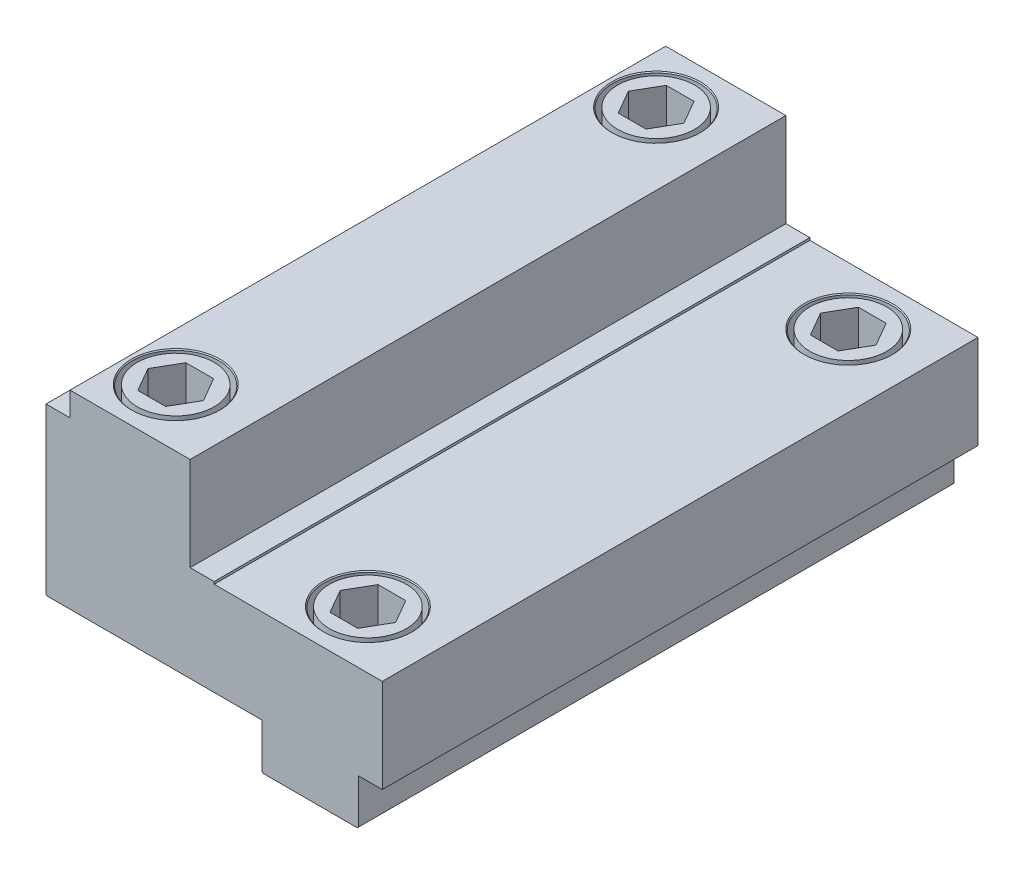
from build123d import *

# Parameters (mm, degrees)
BASIS_LINEAR_AUSTRAGEN_DEPTH         = 124
SCHNITT_LINEAR_AUSTRAGEN2_DEPTH      = 146.417502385
SCHNITT_LINEAR_AUSTRAGEN2_DEPTH_BACK = 146.417502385
SKIZZE2_R                            = 5.5
SKIZZE3_R                            = 9
SCHNITT_LINEAR_AUSTRAGEN3_DEPTH      = 10
SKIZZE5_R                            = 9
SCHNITT_LINEAR_AUSTRAGEN4_DEPTH      = 10
SKIZZE6_W                            = 35
SKIZZE6_H                            = 124
SCHNITT_LINEAR_AUSTRAGEN5_DEPTH      = 0.5
FASE10_SIZE                          = 0.2
SKIZZE7_R                            = 8
AUFSATZ_LINEAR_AUSTRAGEN1_DEPTH      = 10
SKIZZE8_R                            = 8
AUFSATZ_LINEAR_AUSTRAGEN3_DEPTH      = 9.5
AUFSATZ_LINEAR_START                 = -1
SKIZZE7_4_R                          = 8
AUFSATZ_LINEAR_AUSTRAGEN4_DEPTH      = 1
SKIZZE8_2_R                          = 8
AUFSATZ_LINEAR_AUSTRAGEN5_DEPTH      = 1


with BuildPart() as part:
    # Skizze1 → Basis-Linear austragen (new body)
    with BuildSketch(Plane.XY):
        Polygon((0, 0), (0, 34.5), (5, 34.5), (5, 39.5), (30, 39.5), (30, 20), (70, 20), (70, 0), (65, 0), (65, -9.5), (45, -9.5), (45, 0), align=None)
    extrude(amount=-BASIS_LINEAR_AUSTRAGEN_DEPTH)

    # Skizze2 → Schnitt-Linear austragen2 (cut, two sides: drawn at the far end of the back side and taken through both)
    with BuildSketch(Plane(origin=(0, 20, 0), x_dir=(-1, 0, 0), z_dir=(0, 1, 0)).offset(-SCHNITT_LINEAR_AUSTRAGEN2_DEPTH_BACK)):
        with Locations(Location((-55, -112, 0), (0, 0, 90))):
            Circle(SKIZZE2_R)
        with Locations(Location((-55, -12, 0), (0, 0, 90))):
            Circle(SKIZZE2_R)
        with Locations(Location((-15, -112, 0), (0, 0, 90))):
            Circle(SKIZZE2_R)
        with Locations(Location((-15, -12, 0), (0, 0, 90))):
            Circle(SKIZZE2_R)
    extrude(amount=SCHNITT_LINEAR_AUSTRAGEN2_DEPTH + SCHNITT_LINEAR_AUSTRAGEN2_DEPTH_BACK, mode=Mode.SUBTRACT)

    # Skizze3 → Schnitt-Linear austragen3 (cut)
    with BuildSketch(Plane(origin=(0, 20, 0), x_dir=(-1, 0, 0), z_dir=(0, 1, 0))):
        with Locations(Location((-55, -112, 0), (0, 0, 90))):
            Circle(SKIZZE3_R)
        with Locations(Location((-55, -12, 0), (0, 0, 90))):
            Circle(SKIZZE3_R)
    extrude(amount=-SCHNITT_LINEAR_AUSTRAGEN3_DEPTH, mode=Mode.SUBTRACT)

    # Skizze5 → Schnitt-Linear austragen4 (cut)
    with BuildSketch(Plane(origin=(0, 39.5, 0), x_dir=(-1, 0, 0), z_dir=(0, 1, 0))):
        with Locations(Location((-15, -112, 0), (0, 0, 90))):
            Circle(SKIZZE5_R)
        with Locations(Location((-15, -12, 0), (0, 0, 90))):
            Circle(SKIZZE5_R)
    extrude(amount=-SCHNITT_LINEAR_AUSTRAGEN4_DEPTH, mode=Mode.SUBTRACT)

    # Skizze6 → Schnitt-Linear austragen5 (cut)
    with BuildSketch(Plane(origin=(0, 20, 0), x_dir=(-1, 0, 0), z_dir=(0, 1, 0))):
        with Locations((-52.5, -62)):
            Rectangle(SKIZZE6_W, SKIZZE6_H)
    extrude(amount=-SCHNITT_LINEAR_AUSTRAGEN5_DEPTH, mode=Mode.SUBTRACT)

    # Fase10
    fase10_edges = [part.edges().sort_by_distance(p)[0] for p in [
        (0, 0, -62),
        (65, -9.5, -62),
        (45, -9.5, -62),
        (55, -9.5, -117.5),
        (55, -9.5, -17.5),
        (15, 0, -117.5),
        (15, 0, -17.5),
        (55, 10, -117.5),
        (55, 10, -17.5),
        (15, 39.5, -121),
        (15, 29.5, -117.5),
        (15, 39.5, -21),
        (15, 29.5, -17.5),
        (55, 19.5, -121),
        (55, 19.5, -21),
    ]]
    chamfer(fase10_edges, length=FASE10_SIZE)

    # Skizze7 → Aufsatz-Linear austragen1 (add)
    # profile 1 of 2: a face of its own
    with BuildSketch(Plane(origin=(0, 29.5, 29.5), x_dir=(0, 0, -1), z_dir=(0, 1, 0))):
        with Locations(Location((41.5, -15, 0), (0, 0, 90))):
            Circle(SKIZZE7_R)
        Polygon((41.5, -9.226497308), (36.5, -12.113248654), (36.5, -17.886751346), (41.5, -20.773502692), (46.5, -17.886751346), (46.5, -12.113248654), align=None, mode=Mode.SUBTRACT)
    # profile 2 of 2: a face of its own
    with BuildSketch(Plane(origin=(0, 29.5, 29.5), x_dir=(0, 0, -1), z_dir=(0, 1, 0))):
        with Locations(Location((141.5, -15, 0), (0, 0, 90))):
            Circle(SKIZZE7_R)
        Polygon((141.5, -9.226497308), (136.5, -12.113248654), (136.5, -17.886751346), (141.5, -20.773502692), (146.5, -17.886751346), (146.5, -12.113248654), align=None, mode=Mode.SUBTRACT)
    extrude(amount=AUFSATZ_LINEAR_AUSTRAGEN1_DEPTH)

    # Skizze8 → Aufsatz-Linear austragen3 (add)
    # profile 1 of 2: a face of its own
    with BuildSketch(Plane(origin=(0, 10, 0), x_dir=(1, 0, 0), z_dir=(0, 1, 0))):
        with Locations(Location((55, 112, 0), (0, 0, 270))):
            Circle(SKIZZE8_R)
        Polygon((60.773502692, 112), (57.886751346, 117), (52.113248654, 117), (49.226497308, 112), (52.113248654, 107), (57.886751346, 107), align=None, mode=Mode.SUBTRACT)
    # profile 2 of 2: a face of its own
    with BuildSketch(Plane(origin=(0, 10, 0), x_dir=(1, 0, 0), z_dir=(0, 1, 0))):
        with Locations(Location((55, 12, 0), (0, 0, 270))):
            Circle(SKIZZE8_R)
        Polygon((52.113248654, 17), (49.226497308, 12), (52.113248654, 7), (57.886751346, 7), (60.773502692, 12), (57.886751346, 17), align=None, mode=Mode.SUBTRACT)
    extrude(amount=AUFSATZ_LINEAR_AUSTRAGEN3_DEPTH)

    # Skizze7_4 → Aufsatz-Linear austragen4 (add)
    with BuildSketch(Plane(origin=(0, 29.5, 29.5), x_dir=(0, 0, -1), z_dir=(0, 1, 0)).offset(AUFSATZ_LINEAR_START)):
        with Locations(Location((41.5, -15, 0), (0, 0, 90))):
            Circle(SKIZZE7_4_R)
        with Locations(Location((141.5, -15, 0), (0, 0, 90))):
            Circle(SKIZZE7_4_R)
    extrude(amount=AUFSATZ_LINEAR_AUSTRAGEN4_DEPTH)

    # Skizze8_2 → Aufsatz-Linear austragen5 (add)
    with BuildSketch(Plane(origin=(0, 10, 0), x_dir=(1, 0, 0), z_dir=(0, 1, 0)).offset(AUFSATZ_LINEAR_START)):
        with Locations(Location((55, 112, 0), (0, 0, 270))):
            Circle(SKIZZE8_2_R)
        with Locations(Location((55, 12, 0), (0, 0, 270))):
            Circle(SKIZZE8_2_R)
    extrude(amount=AUFSATZ_LINEAR_AUSTRAGEN5_DEPTH)


solid = part.part
